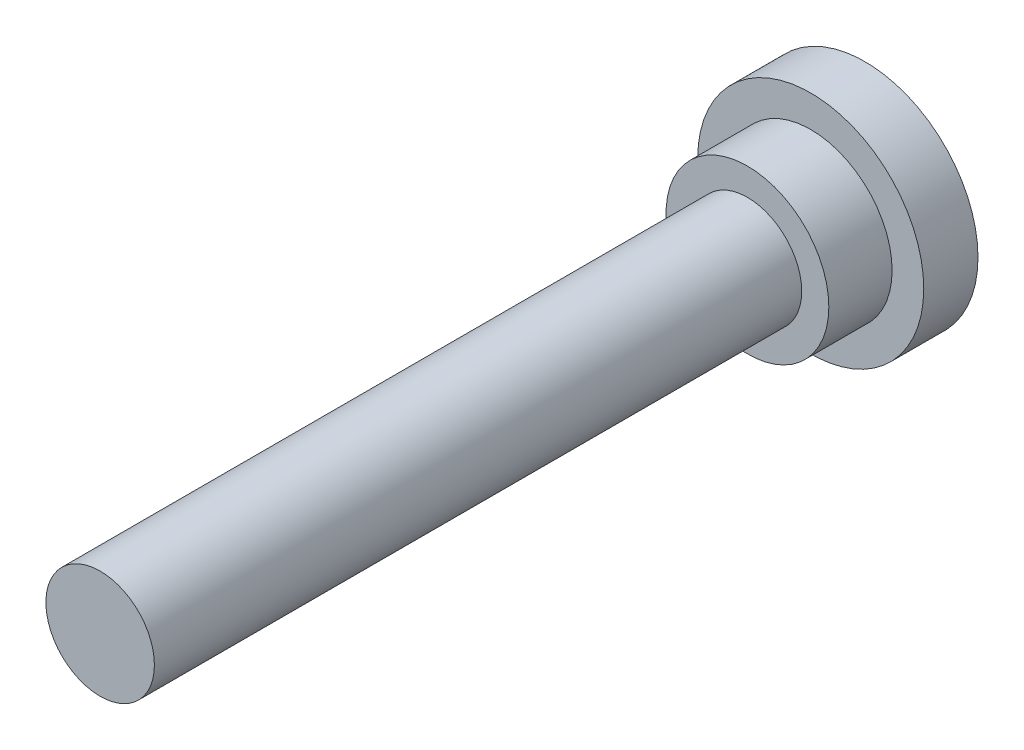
ISO-10303-21;
HEADER;
FILE_DESCRIPTION(('STEP AP214'),'2;1');
FILE_NAME('part.step','',(''),(''),'','','');
FILE_SCHEMA(('AUTOMOTIVE_DESIGN { 1 0 10303 214 1 1 1 1 }'));
ENDSEC;
DATA;
#1=APPLICATION_CONTEXT('core data for automotive mechanical design processes');
#2=APPLICATION_PROTOCOL_DEFINITION('international standard','automotive_design',2000,#1);
#3=PRODUCT_CONTEXT('',#1,'mechanical');
#4=PRODUCT('Part','Part','',(#3));
#5=PRODUCT_RELATED_PRODUCT_CATEGORY('part','',(#4));
#6=PRODUCT_DEFINITION_FORMATION('','',#4);
#7=PRODUCT_DEFINITION_CONTEXT('part definition',#1,'design');
#8=PRODUCT_DEFINITION('design','',#6,#7);
#9=PRODUCT_DEFINITION_SHAPE('','',#8);
#10=(LENGTH_UNIT() NAMED_UNIT(*) SI_UNIT(.MILLI.,.METRE.));
#11=(NAMED_UNIT(*) PLANE_ANGLE_UNIT() SI_UNIT($,.RADIAN.));
#12=(NAMED_UNIT(*) SI_UNIT($,.STERADIAN.) SOLID_ANGLE_UNIT());
#13=UNCERTAINTY_MEASURE_WITH_UNIT(LENGTH_MEASURE(1.E-05),#10,'distance_accuracy_value','');
#14=(GEOMETRIC_REPRESENTATION_CONTEXT(3) GLOBAL_UNCERTAINTY_ASSIGNED_CONTEXT((#13)) GLOBAL_UNIT_ASSIGNED_CONTEXT((#10,
#11,#12)) REPRESENTATION_CONTEXT('',''));
#15=CARTESIAN_POINT('',(0.,0.,0.));
#16=DIRECTION('',(0.,0.,1.));
#17=DIRECTION('',(1.,0.,0.));
#18=AXIS2_PLACEMENT_3D('',#15,#16,#17);
#19=CARTESIAN_POINT('',(0.,0.,84.6));
#20=DIRECTION('',(0.,0.,1.));
#21=DIRECTION('',(1.,0.,0.));
#22=AXIS2_PLACEMENT_3D('',#19,#20,#21);
#23=PLANE('',#22);
#24=CARTESIAN_POINT('',(0.,0.,84.6));
#25=DIRECTION('',(0.,0.,1.));
#26=DIRECTION('',(1.,0.,0.));
#27=AXIS2_PLACEMENT_3D('',#24,#25,#26);
#28=CIRCLE('',#27,6.);
#29=CARTESIAN_POINT('',(6.,0.,84.6));
#30=VERTEX_POINT('',#29);
#31=EDGE_CURVE('E8',#30,#30,#28,.T.);
#32=ORIENTED_EDGE('',*,*,#31,.T.);
#33=EDGE_LOOP('',(#32));
#34=FACE_BOUND('',#33,.T.);
#35=ADVANCED_FACE('F12',(#34),#23,.T.);
#36=CARTESIAN_POINT('',(0.,0.,30.));
#37=DIRECTION('',(0.,0.,1.));
#38=DIRECTION('',(1.,0.,0.));
#39=AXIS2_PLACEMENT_3D('',#36,#37,#38);
#40=CYLINDRICAL_SURFACE('',#39,6.);
#41=CARTESIAN_POINT('',(0.,0.,13.));
#42=DIRECTION('',(0.,0.,1.));
#43=DIRECTION('',(1.,0.,0.));
#44=AXIS2_PLACEMENT_3D('',#41,#42,#43);
#45=CIRCLE('',#44,6.);
#46=CARTESIAN_POINT('',(6.,0.,13.));
#47=VERTEX_POINT('',#46);
#48=EDGE_CURVE('E18',#47,#47,#45,.T.);
#49=ORIENTED_EDGE('',*,*,#48,.T.);
#50=EDGE_LOOP('',(#49));
#51=FACE_BOUND('',#50,.T.);
#52=ORIENTED_EDGE('',*,*,#31,.F.);
#53=EDGE_LOOP('',(#52));
#54=FACE_BOUND('',#53,.T.);
#55=ADVANCED_FACE('F52',(#51,#54),#40,.T.);
#56=CARTESIAN_POINT('',(-6.,0.,13.));
#57=DIRECTION('',(0.,0.,1.));
#58=DIRECTION('',(1.,0.,0.));
#59=AXIS2_PLACEMENT_3D('',#56,#57,#58);
#60=PLANE('',#59);
#61=CARTESIAN_POINT('',(0.,0.,13.));
#62=DIRECTION('',(0.,0.,1.));
#63=DIRECTION('',(1.,0.,0.));
#64=AXIS2_PLACEMENT_3D('',#61,#62,#63);
#65=CIRCLE('',#64,9.);
#66=CARTESIAN_POINT('',(9.,0.,13.));
#67=VERTEX_POINT('',#66);
#68=EDGE_CURVE('E22',#67,#67,#65,.T.);
#69=ORIENTED_EDGE('',*,*,#68,.T.);
#70=EDGE_LOOP('',(#69));
#71=FACE_BOUND('',#70,.T.);
#72=ORIENTED_EDGE('',*,*,#48,.F.);
#73=EDGE_LOOP('',(#72));
#74=FACE_BOUND('',#73,.T.);
#75=ADVANCED_FACE('F57',(#71,#74),#60,.T.);
#76=CARTESIAN_POINT('',(0.,0.,30.));
#77=DIRECTION('',(0.,0.,1.));
#78=DIRECTION('',(1.,0.,0.));
#79=AXIS2_PLACEMENT_3D('',#76,#77,#78);
#80=CYLINDRICAL_SURFACE('',#79,9.);
#81=CARTESIAN_POINT('',(0.,0.,6.));
#82=DIRECTION('',(0.,0.,1.));
#83=DIRECTION('',(1.,0.,0.));
#84=AXIS2_PLACEMENT_3D('',#81,#82,#83);
#85=CIRCLE('',#84,9.);
#86=CARTESIAN_POINT('',(9.,0.,6.));
#87=VERTEX_POINT('',#86);
#88=EDGE_CURVE('E26',#87,#87,#85,.T.);
#89=ORIENTED_EDGE('',*,*,#88,.T.);
#90=EDGE_LOOP('',(#89));
#91=FACE_BOUND('',#90,.T.);
#92=ORIENTED_EDGE('',*,*,#68,.F.);
#93=EDGE_LOOP('',(#92));
#94=FACE_BOUND('',#93,.T.);
#95=ADVANCED_FACE('F62',(#91,#94),#80,.T.);
#96=CARTESIAN_POINT('',(-9.,0.,6.));
#97=DIRECTION('',(0.,0.,1.));
#98=DIRECTION('',(1.,0.,0.));
#99=AXIS2_PLACEMENT_3D('',#96,#97,#98);
#100=PLANE('',#99);
#101=CARTESIAN_POINT('',(0.,0.,6.));
#102=DIRECTION('',(0.,0.,1.));
#103=DIRECTION('',(1.,0.,0.));
#104=AXIS2_PLACEMENT_3D('',#101,#102,#103);
#105=CIRCLE('',#104,12.5);
#106=CARTESIAN_POINT('',(12.5,0.,6.));
#107=VERTEX_POINT('',#106);
#108=EDGE_CURVE('E31',#107,#107,#105,.T.);
#109=ORIENTED_EDGE('',*,*,#108,.T.);
#110=EDGE_LOOP('',(#109));
#111=FACE_BOUND('',#110,.T.);
#112=ORIENTED_EDGE('',*,*,#88,.F.);
#113=EDGE_LOOP('',(#112));
#114=FACE_BOUND('',#113,.T.);
#115=ADVANCED_FACE('F49',(#111,#114),#100,.T.);
#116=CARTESIAN_POINT('',(0.,0.,30.));
#117=DIRECTION('',(0.,0.,1.));
#118=DIRECTION('',(1.,0.,0.));
#119=AXIS2_PLACEMENT_3D('',#116,#117,#118);
#120=CYLINDRICAL_SURFACE('',#119,12.5);
#121=CARTESIAN_POINT('',(0.,0.,0.));
#122=DIRECTION('',(0.,0.,1.));
#123=DIRECTION('',(1.,0.,0.));
#124=AXIS2_PLACEMENT_3D('',#121,#122,#123);
#125=CIRCLE('',#124,12.5);
#126=CARTESIAN_POINT('',(12.5,0.,0.));
#127=VERTEX_POINT('',#126);
#128=EDGE_CURVE('E34',#127,#127,#125,.T.);
#129=ORIENTED_EDGE('',*,*,#128,.T.);
#130=EDGE_LOOP('',(#129));
#131=FACE_BOUND('',#130,.T.);
#132=ORIENTED_EDGE('',*,*,#108,.F.);
#133=EDGE_LOOP('',(#132));
#134=FACE_BOUND('',#133,.T.);
#135=ADVANCED_FACE('F38',(#131,#134),#120,.T.);
#136=CARTESIAN_POINT('',(-12.5,0.,0.));
#137=DIRECTION('',(0.,0.,-1.));
#138=DIRECTION('',(-1.,0.,0.));
#139=AXIS2_PLACEMENT_3D('',#136,#137,#138);
#140=PLANE('',#139);
#141=ORIENTED_EDGE('',*,*,#128,.F.);
#142=EDGE_LOOP('',(#141));
#143=FACE_BOUND('',#142,.T.);
#144=ADVANCED_FACE('F41',(#143),#140,.T.);
#145=CLOSED_SHELL('',(#35,#55,#75,#95,#115,#135,#144));
#146=MANIFOLD_SOLID_BREP('B1',#145);
#147=ADVANCED_BREP_SHAPE_REPRESENTATION('',(#18,#146),#14);
#148=SHAPE_DEFINITION_REPRESENTATION(#9,#147);
ENDSEC;
END-ISO-10303-21;
